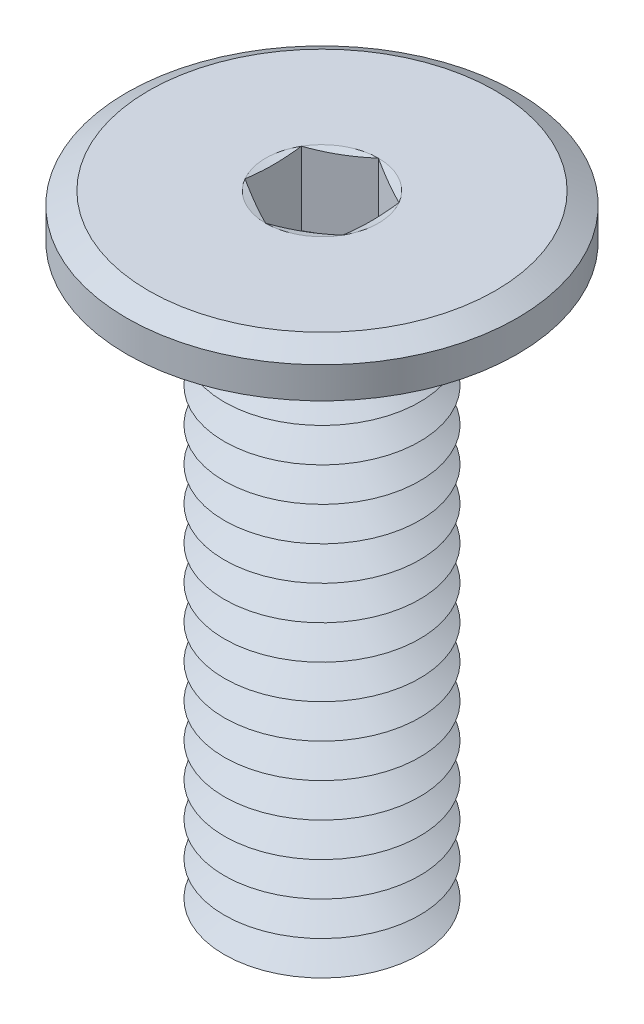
ISO-10303-21;
HEADER;
FILE_DESCRIPTION(('STEP AP214'),'2;1');
FILE_NAME('part.step','',(''),(''),'','','');
FILE_SCHEMA(('AUTOMOTIVE_DESIGN { 1 0 10303 214 1 1 1 1 }'));
ENDSEC;
DATA;
#1=APPLICATION_CONTEXT('core data for automotive mechanical design processes');
#2=APPLICATION_PROTOCOL_DEFINITION('international standard','automotive_design',2000,#1);
#3=PRODUCT_CONTEXT('',#1,'mechanical');
#4=PRODUCT('Part','Part','',(#3));
#5=PRODUCT_RELATED_PRODUCT_CATEGORY('part','',(#4));
#6=PRODUCT_DEFINITION_FORMATION('','',#4);
#7=PRODUCT_DEFINITION_CONTEXT('part definition',#1,'design');
#8=PRODUCT_DEFINITION('design','',#6,#7);
#9=PRODUCT_DEFINITION_SHAPE('','',#8);
#10=(LENGTH_UNIT() NAMED_UNIT(*) SI_UNIT(.MILLI.,.METRE.));
#11=(NAMED_UNIT(*) PLANE_ANGLE_UNIT() SI_UNIT($,.RADIAN.));
#12=(NAMED_UNIT(*) SI_UNIT($,.STERADIAN.) SOLID_ANGLE_UNIT());
#13=UNCERTAINTY_MEASURE_WITH_UNIT(LENGTH_MEASURE(1.E-05),#10,'distance_accuracy_value','');
#14=(GEOMETRIC_REPRESENTATION_CONTEXT(3) GLOBAL_UNCERTAINTY_ASSIGNED_CONTEXT((#13)) GLOBAL_UNIT_ASSIGNED_CONTEXT((#10,
#11,#12)) REPRESENTATION_CONTEXT('',''));
#15=CARTESIAN_POINT('',(0.,0.,0.));
#16=DIRECTION('',(0.,0.,1.));
#17=DIRECTION('',(1.,0.,0.));
#18=AXIS2_PLACEMENT_3D('',#15,#16,#17);
#19=CARTESIAN_POINT('',(0.,-11.85,0.));
#20=DIRECTION('',(0.,-1.,0.));
#21=DIRECTION('',(0.,0.,-1.));
#22=AXIS2_PLACEMENT_3D('',#19,#20,#21);
#23=CONICAL_SURFACE('',#22,2.,1.0471975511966);
#24=CARTESIAN_POINT('',(0.,-11.5,0.));
#25=DIRECTION('',(0.,1.,0.));
#26=DIRECTION('',(0.,0.,1.));
#27=AXIS2_PLACEMENT_3D('',#24,#25,#26);
#28=CIRCLE('',#27,1.39378221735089);
#29=CARTESIAN_POINT('',(0.,-11.5,1.39378221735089));
#30=VERTEX_POINT('',#29);
#31=EDGE_CURVE('E485',#30,#30,#28,.T.);
#32=ORIENTED_EDGE('',*,*,#31,.F.);
#33=EDGE_LOOP('',(#32));
#34=FACE_BOUND('',#33,.T.);
#35=CARTESIAN_POINT('',(0.,-11.85,0.));
#36=DIRECTION('',(0.,1.,0.));
#37=DIRECTION('',(0.,0.,1.));
#38=AXIS2_PLACEMENT_3D('',#35,#36,#37);
#39=CIRCLE('',#38,2.);
#40=CARTESIAN_POINT('',(0.,-11.85,2.));
#41=VERTEX_POINT('',#40);
#42=EDGE_CURVE('E489',#41,#41,#39,.T.);
#43=ORIENTED_EDGE('',*,*,#42,.T.);
#44=EDGE_LOOP('',(#43));
#45=FACE_BOUND('',#44,.T.);
#46=ADVANCED_FACE('F39',(#34,#45),#23,.T.);
#47=CARTESIAN_POINT('',(0.,-11.5,0.));
#48=DIRECTION('',(0.,1.,0.));
#49=DIRECTION('',(0.,0.,1.));
#50=AXIS2_PLACEMENT_3D('',#47,#48,#49);
#51=CONICAL_SURFACE('',#50,1.39378221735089,1.0471975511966);
#52=CARTESIAN_POINT('',(0.,-11.15,0.));
#53=DIRECTION('',(0.,1.,0.));
#54=DIRECTION('',(0.,0.,1.));
#55=AXIS2_PLACEMENT_3D('',#52,#53,#54);
#56=CIRCLE('',#55,2.);
#57=CARTESIAN_POINT('',(0.,-11.15,2.));
#58=VERTEX_POINT('',#57);
#59=EDGE_CURVE('E481',#58,#58,#56,.T.);
#60=ORIENTED_EDGE('',*,*,#59,.F.);
#61=EDGE_LOOP('',(#60));
#62=FACE_BOUND('',#61,.T.);
#63=ORIENTED_EDGE('',*,*,#31,.T.);
#64=EDGE_LOOP('',(#63));
#65=FACE_BOUND('',#64,.T.);
#66=ADVANCED_FACE('F233',(#62,#65),#51,.T.);
#67=CARTESIAN_POINT('',(0.,-12.9,0.));
#68=DIRECTION('',(0.,-1.,0.));
#69=DIRECTION('',(0.,0.,-1.));
#70=AXIS2_PLACEMENT_3D('',#67,#68,#69);
#71=PLANE('',#70);
#72=CARTESIAN_POINT('',(0.,-12.9,0.));
#73=DIRECTION('',(0.,1.,0.));
#74=DIRECTION('',(0.,0.,1.));
#75=AXIS2_PLACEMENT_3D('',#72,#73,#74);
#76=CIRCLE('',#75,1.39378221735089);
#77=CARTESIAN_POINT('',(0.,-12.9,1.39378221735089));
#78=VERTEX_POINT('',#77);
#79=EDGE_CURVE('E300',#78,#78,#76,.T.);
#80=ORIENTED_EDGE('',*,*,#79,.F.);
#81=EDGE_LOOP('',(#80));
#82=FACE_BOUND('',#81,.T.);
#83=ADVANCED_FACE('F239',(#82),#71,.T.);
#84=CARTESIAN_POINT('',(0.,-12.9,0.));
#85=DIRECTION('',(0.,1.,0.));
#86=DIRECTION('',(0.,0.,1.));
#87=AXIS2_PLACEMENT_3D('',#84,#85,#86);
#88=CONICAL_SURFACE('',#87,1.39378221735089,1.0471975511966);
#89=CARTESIAN_POINT('',(0.,-12.55,0.));
#90=DIRECTION('',(0.,1.,0.));
#91=DIRECTION('',(0.,0.,1.));
#92=AXIS2_PLACEMENT_3D('',#89,#90,#91);
#93=CIRCLE('',#92,2.);
#94=CARTESIAN_POINT('',(0.,-12.55,2.));
#95=VERTEX_POINT('',#94);
#96=EDGE_CURVE('E496',#95,#95,#93,.T.);
#97=ORIENTED_EDGE('',*,*,#96,.F.);
#98=EDGE_LOOP('',(#97));
#99=FACE_BOUND('',#98,.T.);
#100=ORIENTED_EDGE('',*,*,#79,.T.);
#101=EDGE_LOOP('',(#100));
#102=FACE_BOUND('',#101,.T.);
#103=ADVANCED_FACE('F254',(#99,#102),#88,.T.);
#104=CARTESIAN_POINT('',(0.,-12.55,0.));
#105=DIRECTION('',(0.,-1.,0.));
#106=DIRECTION('',(0.,0.,-1.));
#107=AXIS2_PLACEMENT_3D('',#104,#105,#106);
#108=CONICAL_SURFACE('',#107,2.,1.0471975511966);
#109=CARTESIAN_POINT('',(0.,-12.2,0.));
#110=DIRECTION('',(0.,1.,0.));
#111=DIRECTION('',(0.,0.,1.));
#112=AXIS2_PLACEMENT_3D('',#109,#110,#111);
#113=CIRCLE('',#112,1.39378221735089);
#114=CARTESIAN_POINT('',(0.,-12.2,1.39378221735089));
#115=VERTEX_POINT('',#114);
#116=EDGE_CURVE('E492',#115,#115,#113,.T.);
#117=ORIENTED_EDGE('',*,*,#116,.F.);
#118=EDGE_LOOP('',(#117));
#119=FACE_BOUND('',#118,.T.);
#120=ORIENTED_EDGE('',*,*,#96,.T.);
#121=EDGE_LOOP('',(#120));
#122=FACE_BOUND('',#121,.T.);
#123=ADVANCED_FACE('F250',(#119,#122),#108,.T.);
#124=CARTESIAN_POINT('',(0.,-12.2,0.));
#125=DIRECTION('',(0.,1.,0.));
#126=DIRECTION('',(0.,0.,1.));
#127=AXIS2_PLACEMENT_3D('',#124,#125,#126);
#128=CONICAL_SURFACE('',#127,1.39378221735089,1.0471975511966);
#129=ORIENTED_EDGE('',*,*,#42,.F.);
#130=EDGE_LOOP('',(#129));
#131=FACE_BOUND('',#130,.T.);
#132=ORIENTED_EDGE('',*,*,#116,.T.);
#133=EDGE_LOOP('',(#132));
#134=FACE_BOUND('',#133,.T.);
#135=ADVANCED_FACE('F246',(#131,#134),#128,.T.);
#136=CARTESIAN_POINT('',(0.,-11.15,0.));
#137=DIRECTION('',(0.,-1.,0.));
#138=DIRECTION('',(0.,0.,-1.));
#139=AXIS2_PLACEMENT_3D('',#136,#137,#138);
#140=CONICAL_SURFACE('',#139,2.,1.0471975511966);
#141=CARTESIAN_POINT('',(0.,-10.8,0.));
#142=DIRECTION('',(0.,1.,0.));
#143=DIRECTION('',(0.,0.,1.));
#144=AXIS2_PLACEMENT_3D('',#141,#142,#143);
#145=CIRCLE('',#144,1.39378221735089);
#146=CARTESIAN_POINT('',(0.,-10.8,1.39378221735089));
#147=VERTEX_POINT('',#146);
#148=EDGE_CURVE('E478',#147,#147,#145,.T.);
#149=ORIENTED_EDGE('',*,*,#148,.F.);
#150=EDGE_LOOP('',(#149));
#151=FACE_BOUND('',#150,.T.);
#152=ORIENTED_EDGE('',*,*,#59,.T.);
#153=EDGE_LOOP('',(#152));
#154=FACE_BOUND('',#153,.T.);
#155=ADVANCED_FACE('F249',(#151,#154),#140,.T.);
#156=CARTESIAN_POINT('',(0.,-10.8,0.));
#157=DIRECTION('',(0.,1.,0.));
#158=DIRECTION('',(0.,0.,1.));
#159=AXIS2_PLACEMENT_3D('',#156,#157,#158);
#160=CONICAL_SURFACE('',#159,1.39378221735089,1.0471975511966);
#161=CARTESIAN_POINT('',(0.,-10.45,0.));
#162=DIRECTION('',(0.,1.,0.));
#163=DIRECTION('',(0.,0.,1.));
#164=AXIS2_PLACEMENT_3D('',#161,#162,#163);
#165=CIRCLE('',#164,2.);
#166=CARTESIAN_POINT('',(0.,-10.45,2.));
#167=VERTEX_POINT('',#166);
#168=EDGE_CURVE('E474',#167,#167,#165,.T.);
#169=ORIENTED_EDGE('',*,*,#168,.F.);
#170=EDGE_LOOP('',(#169));
#171=FACE_BOUND('',#170,.T.);
#172=ORIENTED_EDGE('',*,*,#148,.T.);
#173=EDGE_LOOP('',(#172));
#174=FACE_BOUND('',#173,.T.);
#175=ADVANCED_FACE('F804',(#171,#174),#160,.T.);
#176=CARTESIAN_POINT('',(0.,-10.45,0.));
#177=DIRECTION('',(0.,-1.,0.));
#178=DIRECTION('',(0.,0.,-1.));
#179=AXIS2_PLACEMENT_3D('',#176,#177,#178);
#180=CONICAL_SURFACE('',#179,2.,1.0471975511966);
#181=CARTESIAN_POINT('',(0.,-10.1,0.));
#182=DIRECTION('',(0.,1.,0.));
#183=DIRECTION('',(0.,0.,1.));
#184=AXIS2_PLACEMENT_3D('',#181,#182,#183);
#185=CIRCLE('',#184,1.39378221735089);
#186=CARTESIAN_POINT('',(0.,-10.1,1.39378221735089));
#187=VERTEX_POINT('',#186);
#188=EDGE_CURVE('E470',#187,#187,#185,.T.);
#189=ORIENTED_EDGE('',*,*,#188,.F.);
#190=EDGE_LOOP('',(#189));
#191=FACE_BOUND('',#190,.T.);
#192=ORIENTED_EDGE('',*,*,#168,.T.);
#193=EDGE_LOOP('',(#192));
#194=FACE_BOUND('',#193,.T.);
#195=ADVANCED_FACE('F795',(#191,#194),#180,.T.);
#196=CARTESIAN_POINT('',(0.,-10.1,0.));
#197=DIRECTION('',(0.,1.,0.));
#198=DIRECTION('',(0.,0.,1.));
#199=AXIS2_PLACEMENT_3D('',#196,#197,#198);
#200=CONICAL_SURFACE('',#199,1.39378221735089,1.0471975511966);
#201=CARTESIAN_POINT('',(0.,-9.75,0.));
#202=DIRECTION('',(0.,1.,0.));
#203=DIRECTION('',(0.,0.,1.));
#204=AXIS2_PLACEMENT_3D('',#201,#202,#203);
#205=CIRCLE('',#204,2.);
#206=CARTESIAN_POINT('',(0.,-9.75,2.));
#207=VERTEX_POINT('',#206);
#208=EDGE_CURVE('E466',#207,#207,#205,.T.);
#209=ORIENTED_EDGE('',*,*,#208,.F.);
#210=EDGE_LOOP('',(#209));
#211=FACE_BOUND('',#210,.T.);
#212=ORIENTED_EDGE('',*,*,#188,.T.);
#213=EDGE_LOOP('',(#212));
#214=FACE_BOUND('',#213,.T.);
#215=ADVANCED_FACE('F786',(#211,#214),#200,.T.);
#216=CARTESIAN_POINT('',(0.,-9.75,0.));
#217=DIRECTION('',(0.,-1.,0.));
#218=DIRECTION('',(0.,0.,-1.));
#219=AXIS2_PLACEMENT_3D('',#216,#217,#218);
#220=CONICAL_SURFACE('',#219,2.,1.0471975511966);
#221=CARTESIAN_POINT('',(0.,-9.4,0.));
#222=DIRECTION('',(0.,1.,0.));
#223=DIRECTION('',(0.,0.,1.));
#224=AXIS2_PLACEMENT_3D('',#221,#222,#223);
#225=CIRCLE('',#224,1.39378221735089);
#226=CARTESIAN_POINT('',(0.,-9.4,1.39378221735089));
#227=VERTEX_POINT('',#226);
#228=EDGE_CURVE('E462',#227,#227,#225,.T.);
#229=ORIENTED_EDGE('',*,*,#228,.F.);
#230=EDGE_LOOP('',(#229));
#231=FACE_BOUND('',#230,.T.);
#232=ORIENTED_EDGE('',*,*,#208,.T.);
#233=EDGE_LOOP('',(#232));
#234=FACE_BOUND('',#233,.T.);
#235=ADVANCED_FACE('F777',(#231,#234),#220,.T.);
#236=CARTESIAN_POINT('',(0.,-9.4,0.));
#237=DIRECTION('',(0.,1.,0.));
#238=DIRECTION('',(0.,0.,1.));
#239=AXIS2_PLACEMENT_3D('',#236,#237,#238);
#240=CONICAL_SURFACE('',#239,1.39378221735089,1.0471975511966);
#241=CARTESIAN_POINT('',(0.,-9.05,0.));
#242=DIRECTION('',(0.,1.,0.));
#243=DIRECTION('',(0.,0.,1.));
#244=AXIS2_PLACEMENT_3D('',#241,#242,#243);
#245=CIRCLE('',#244,2.);
#246=CARTESIAN_POINT('',(0.,-9.05,2.));
#247=VERTEX_POINT('',#246);
#248=EDGE_CURVE('E458',#247,#247,#245,.T.);
#249=ORIENTED_EDGE('',*,*,#248,.F.);
#250=EDGE_LOOP('',(#249));
#251=FACE_BOUND('',#250,.T.);
#252=ORIENTED_EDGE('',*,*,#228,.T.);
#253=EDGE_LOOP('',(#252));
#254=FACE_BOUND('',#253,.T.);
#255=ADVANCED_FACE('F768',(#251,#254),#240,.T.);
#256=CARTESIAN_POINT('',(0.,-9.05,0.));
#257=DIRECTION('',(0.,-1.,0.));
#258=DIRECTION('',(0.,0.,-1.));
#259=AXIS2_PLACEMENT_3D('',#256,#257,#258);
#260=CONICAL_SURFACE('',#259,2.,1.0471975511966);
#261=CARTESIAN_POINT('',(0.,-8.7,0.));
#262=DIRECTION('',(0.,1.,0.));
#263=DIRECTION('',(0.,0.,1.));
#264=AXIS2_PLACEMENT_3D('',#261,#262,#263);
#265=CIRCLE('',#264,1.39378221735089);
#266=CARTESIAN_POINT('',(0.,-8.7,1.39378221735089));
#267=VERTEX_POINT('',#266);
#268=EDGE_CURVE('E454',#267,#267,#265,.T.);
#269=ORIENTED_EDGE('',*,*,#268,.F.);
#270=EDGE_LOOP('',(#269));
#271=FACE_BOUND('',#270,.T.);
#272=ORIENTED_EDGE('',*,*,#248,.T.);
#273=EDGE_LOOP('',(#272));
#274=FACE_BOUND('',#273,.T.);
#275=ADVANCED_FACE('F759',(#271,#274),#260,.T.);
#276=CARTESIAN_POINT('',(0.,-8.7,0.));
#277=DIRECTION('',(0.,1.,0.));
#278=DIRECTION('',(0.,0.,1.));
#279=AXIS2_PLACEMENT_3D('',#276,#277,#278);
#280=CONICAL_SURFACE('',#279,1.39378221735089,1.0471975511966);
#281=CARTESIAN_POINT('',(0.,-8.35,0.));
#282=DIRECTION('',(0.,1.,0.));
#283=DIRECTION('',(0.,0.,1.));
#284=AXIS2_PLACEMENT_3D('',#281,#282,#283);
#285=CIRCLE('',#284,2.);
#286=CARTESIAN_POINT('',(0.,-8.35,2.));
#287=VERTEX_POINT('',#286);
#288=EDGE_CURVE('E450',#287,#287,#285,.T.);
#289=ORIENTED_EDGE('',*,*,#288,.F.);
#290=EDGE_LOOP('',(#289));
#291=FACE_BOUND('',#290,.T.);
#292=ORIENTED_EDGE('',*,*,#268,.T.);
#293=EDGE_LOOP('',(#292));
#294=FACE_BOUND('',#293,.T.);
#295=ADVANCED_FACE('F750',(#291,#294),#280,.T.);
#296=CARTESIAN_POINT('',(0.,-8.35,0.));
#297=DIRECTION('',(0.,-1.,0.));
#298=DIRECTION('',(0.,0.,-1.));
#299=AXIS2_PLACEMENT_3D('',#296,#297,#298);
#300=CONICAL_SURFACE('',#299,2.,1.0471975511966);
#301=CARTESIAN_POINT('',(0.,-8.,0.));
#302=DIRECTION('',(0.,1.,0.));
#303=DIRECTION('',(0.,0.,1.));
#304=AXIS2_PLACEMENT_3D('',#301,#302,#303);
#305=CIRCLE('',#304,1.39378221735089);
#306=CARTESIAN_POINT('',(0.,-8.,1.39378221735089));
#307=VERTEX_POINT('',#306);
#308=EDGE_CURVE('E446',#307,#307,#305,.T.);
#309=ORIENTED_EDGE('',*,*,#308,.F.);
#310=EDGE_LOOP('',(#309));
#311=FACE_BOUND('',#310,.T.);
#312=ORIENTED_EDGE('',*,*,#288,.T.);
#313=EDGE_LOOP('',(#312));
#314=FACE_BOUND('',#313,.T.);
#315=ADVANCED_FACE('F741',(#311,#314),#300,.T.);
#316=CARTESIAN_POINT('',(0.,-8.,0.));
#317=DIRECTION('',(0.,1.,0.));
#318=DIRECTION('',(0.,0.,1.));
#319=AXIS2_PLACEMENT_3D('',#316,#317,#318);
#320=CONICAL_SURFACE('',#319,1.39378221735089,1.0471975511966);
#321=CARTESIAN_POINT('',(0.,-7.65,0.));
#322=DIRECTION('',(0.,1.,0.));
#323=DIRECTION('',(0.,0.,1.));
#324=AXIS2_PLACEMENT_3D('',#321,#322,#323);
#325=CIRCLE('',#324,2.);
#326=CARTESIAN_POINT('',(0.,-7.65,2.));
#327=VERTEX_POINT('',#326);
#328=EDGE_CURVE('E442',#327,#327,#325,.T.);
#329=ORIENTED_EDGE('',*,*,#328,.F.);
#330=EDGE_LOOP('',(#329));
#331=FACE_BOUND('',#330,.T.);
#332=ORIENTED_EDGE('',*,*,#308,.T.);
#333=EDGE_LOOP('',(#332));
#334=FACE_BOUND('',#333,.T.);
#335=ADVANCED_FACE('F732',(#331,#334),#320,.T.);
#336=CARTESIAN_POINT('',(0.,-7.65,0.));
#337=DIRECTION('',(0.,-1.,0.));
#338=DIRECTION('',(0.,0.,-1.));
#339=AXIS2_PLACEMENT_3D('',#336,#337,#338);
#340=CONICAL_SURFACE('',#339,2.,1.0471975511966);
#341=CARTESIAN_POINT('',(0.,-7.3,0.));
#342=DIRECTION('',(0.,1.,0.));
#343=DIRECTION('',(0.,0.,1.));
#344=AXIS2_PLACEMENT_3D('',#341,#342,#343);
#345=CIRCLE('',#344,1.39378221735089);
#346=CARTESIAN_POINT('',(0.,-7.3,1.39378221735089));
#347=VERTEX_POINT('',#346);
#348=EDGE_CURVE('E438',#347,#347,#345,.T.);
#349=ORIENTED_EDGE('',*,*,#348,.F.);
#350=EDGE_LOOP('',(#349));
#351=FACE_BOUND('',#350,.T.);
#352=ORIENTED_EDGE('',*,*,#328,.T.);
#353=EDGE_LOOP('',(#352));
#354=FACE_BOUND('',#353,.T.);
#355=ADVANCED_FACE('F723',(#351,#354),#340,.T.);
#356=CARTESIAN_POINT('',(0.,-7.3,0.));
#357=DIRECTION('',(0.,1.,0.));
#358=DIRECTION('',(0.,0.,1.));
#359=AXIS2_PLACEMENT_3D('',#356,#357,#358);
#360=CONICAL_SURFACE('',#359,1.39378221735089,1.0471975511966);
#361=CARTESIAN_POINT('',(0.,-6.95,0.));
#362=DIRECTION('',(0.,1.,0.));
#363=DIRECTION('',(0.,0.,1.));
#364=AXIS2_PLACEMENT_3D('',#361,#362,#363);
#365=CIRCLE('',#364,2.);
#366=CARTESIAN_POINT('',(0.,-6.95,2.));
#367=VERTEX_POINT('',#366);
#368=EDGE_CURVE('E434',#367,#367,#365,.T.);
#369=ORIENTED_EDGE('',*,*,#368,.F.);
#370=EDGE_LOOP('',(#369));
#371=FACE_BOUND('',#370,.T.);
#372=ORIENTED_EDGE('',*,*,#348,.T.);
#373=EDGE_LOOP('',(#372));
#374=FACE_BOUND('',#373,.T.);
#375=ADVANCED_FACE('F714',(#371,#374),#360,.T.);
#376=CARTESIAN_POINT('',(0.,-6.95,0.));
#377=DIRECTION('',(0.,-1.,0.));
#378=DIRECTION('',(0.,0.,-1.));
#379=AXIS2_PLACEMENT_3D('',#376,#377,#378);
#380=CONICAL_SURFACE('',#379,2.,1.0471975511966);
#381=CARTESIAN_POINT('',(0.,-6.6,0.));
#382=DIRECTION('',(0.,1.,0.));
#383=DIRECTION('',(0.,0.,1.));
#384=AXIS2_PLACEMENT_3D('',#381,#382,#383);
#385=CIRCLE('',#384,1.39378221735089);
#386=CARTESIAN_POINT('',(0.,-6.6,1.39378221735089));
#387=VERTEX_POINT('',#386);
#388=EDGE_CURVE('E430',#387,#387,#385,.T.);
#389=ORIENTED_EDGE('',*,*,#388,.F.);
#390=EDGE_LOOP('',(#389));
#391=FACE_BOUND('',#390,.T.);
#392=ORIENTED_EDGE('',*,*,#368,.T.);
#393=EDGE_LOOP('',(#392));
#394=FACE_BOUND('',#393,.T.);
#395=ADVANCED_FACE('F705',(#391,#394),#380,.T.);
#396=CARTESIAN_POINT('',(0.,-6.6,0.));
#397=DIRECTION('',(0.,1.,0.));
#398=DIRECTION('',(0.,0.,1.));
#399=AXIS2_PLACEMENT_3D('',#396,#397,#398);
#400=CONICAL_SURFACE('',#399,1.39378221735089,1.0471975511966);
#401=CARTESIAN_POINT('',(0.,-6.25,0.));
#402=DIRECTION('',(0.,1.,0.));
#403=DIRECTION('',(0.,0.,1.));
#404=AXIS2_PLACEMENT_3D('',#401,#402,#403);
#405=CIRCLE('',#404,2.);
#406=CARTESIAN_POINT('',(0.,-6.25,2.));
#407=VERTEX_POINT('',#406);
#408=EDGE_CURVE('E426',#407,#407,#405,.T.);
#409=ORIENTED_EDGE('',*,*,#408,.F.);
#410=EDGE_LOOP('',(#409));
#411=FACE_BOUND('',#410,.T.);
#412=ORIENTED_EDGE('',*,*,#388,.T.);
#413=EDGE_LOOP('',(#412));
#414=FACE_BOUND('',#413,.T.);
#415=ADVANCED_FACE('F696',(#411,#414),#400,.T.);
#416=CARTESIAN_POINT('',(0.,-6.25,0.));
#417=DIRECTION('',(0.,-1.,0.));
#418=DIRECTION('',(0.,0.,-1.));
#419=AXIS2_PLACEMENT_3D('',#416,#417,#418);
#420=CONICAL_SURFACE('',#419,2.,1.0471975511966);
#421=CARTESIAN_POINT('',(0.,-5.9,0.));
#422=DIRECTION('',(0.,1.,0.));
#423=DIRECTION('',(0.,0.,1.));
#424=AXIS2_PLACEMENT_3D('',#421,#422,#423);
#425=CIRCLE('',#424,1.39378221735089);
#426=CARTESIAN_POINT('',(0.,-5.9,1.39378221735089));
#427=VERTEX_POINT('',#426);
#428=EDGE_CURVE('E422',#427,#427,#425,.T.);
#429=ORIENTED_EDGE('',*,*,#428,.F.);
#430=EDGE_LOOP('',(#429));
#431=FACE_BOUND('',#430,.T.);
#432=ORIENTED_EDGE('',*,*,#408,.T.);
#433=EDGE_LOOP('',(#432));
#434=FACE_BOUND('',#433,.T.);
#435=ADVANCED_FACE('F687',(#431,#434),#420,.T.);
#436=CARTESIAN_POINT('',(0.,-5.9,0.));
#437=DIRECTION('',(0.,1.,0.));
#438=DIRECTION('',(0.,0.,1.));
#439=AXIS2_PLACEMENT_3D('',#436,#437,#438);
#440=CONICAL_SURFACE('',#439,1.39378221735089,1.0471975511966);
#441=CARTESIAN_POINT('',(0.,-5.55,0.));
#442=DIRECTION('',(0.,1.,0.));
#443=DIRECTION('',(0.,0.,1.));
#444=AXIS2_PLACEMENT_3D('',#441,#442,#443);
#445=CIRCLE('',#444,2.);
#446=CARTESIAN_POINT('',(0.,-5.55,2.));
#447=VERTEX_POINT('',#446);
#448=EDGE_CURVE('E418',#447,#447,#445,.T.);
#449=ORIENTED_EDGE('',*,*,#448,.F.);
#450=EDGE_LOOP('',(#449));
#451=FACE_BOUND('',#450,.T.);
#452=ORIENTED_EDGE('',*,*,#428,.T.);
#453=EDGE_LOOP('',(#452));
#454=FACE_BOUND('',#453,.T.);
#455=ADVANCED_FACE('F678',(#451,#454),#440,.T.);
#456=CARTESIAN_POINT('',(0.,-5.55,0.));
#457=DIRECTION('',(0.,-1.,0.));
#458=DIRECTION('',(0.,0.,-1.));
#459=AXIS2_PLACEMENT_3D('',#456,#457,#458);
#460=CONICAL_SURFACE('',#459,2.,1.0471975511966);
#461=CARTESIAN_POINT('',(0.,-5.2,0.));
#462=DIRECTION('',(0.,1.,0.));
#463=DIRECTION('',(0.,0.,1.));
#464=AXIS2_PLACEMENT_3D('',#461,#462,#463);
#465=CIRCLE('',#464,1.39378221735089);
#466=CARTESIAN_POINT('',(0.,-5.2,1.39378221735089));
#467=VERTEX_POINT('',#466);
#468=EDGE_CURVE('E414',#467,#467,#465,.T.);
#469=ORIENTED_EDGE('',*,*,#468,.F.);
#470=EDGE_LOOP('',(#469));
#471=FACE_BOUND('',#470,.T.);
#472=ORIENTED_EDGE('',*,*,#448,.T.);
#473=EDGE_LOOP('',(#472));
#474=FACE_BOUND('',#473,.T.);
#475=ADVANCED_FACE('F669',(#471,#474),#460,.T.);
#476=CARTESIAN_POINT('',(0.,-5.2,0.));
#477=DIRECTION('',(0.,1.,0.));
#478=DIRECTION('',(0.,0.,1.));
#479=AXIS2_PLACEMENT_3D('',#476,#477,#478);
#480=CONICAL_SURFACE('',#479,1.39378221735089,1.0471975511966);
#481=CARTESIAN_POINT('',(0.,-4.85,0.));
#482=DIRECTION('',(0.,1.,0.));
#483=DIRECTION('',(0.,0.,1.));
#484=AXIS2_PLACEMENT_3D('',#481,#482,#483);
#485=CIRCLE('',#484,2.);
#486=CARTESIAN_POINT('',(0.,-4.85,2.));
#487=VERTEX_POINT('',#486);
#488=EDGE_CURVE('E410',#487,#487,#485,.T.);
#489=ORIENTED_EDGE('',*,*,#488,.F.);
#490=EDGE_LOOP('',(#489));
#491=FACE_BOUND('',#490,.T.);
#492=ORIENTED_EDGE('',*,*,#468,.T.);
#493=EDGE_LOOP('',(#492));
#494=FACE_BOUND('',#493,.T.);
#495=ADVANCED_FACE('F660',(#491,#494),#480,.T.);
#496=CARTESIAN_POINT('',(0.,-4.85,0.));
#497=DIRECTION('',(0.,-1.,0.));
#498=DIRECTION('',(0.,0.,-1.));
#499=AXIS2_PLACEMENT_3D('',#496,#497,#498);
#500=CONICAL_SURFACE('',#499,2.,1.0471975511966);
#501=CARTESIAN_POINT('',(0.,-4.5,0.));
#502=DIRECTION('',(0.,1.,0.));
#503=DIRECTION('',(0.,0.,1.));
#504=AXIS2_PLACEMENT_3D('',#501,#502,#503);
#505=CIRCLE('',#504,1.39378221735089);
#506=CARTESIAN_POINT('',(0.,-4.5,1.39378221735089));
#507=VERTEX_POINT('',#506);
#508=EDGE_CURVE('E407',#507,#507,#505,.T.);
#509=ORIENTED_EDGE('',*,*,#508,.F.);
#510=EDGE_LOOP('',(#509));
#511=FACE_BOUND('',#510,.T.);
#512=ORIENTED_EDGE('',*,*,#488,.T.);
#513=EDGE_LOOP('',(#512));
#514=FACE_BOUND('',#513,.T.);
#515=ADVANCED_FACE('F651',(#511,#514),#500,.T.);
#516=CARTESIAN_POINT('',(0.,-4.5,0.));
#517=DIRECTION('',(0.,1.,0.));
#518=DIRECTION('',(0.,0.,1.));
#519=AXIS2_PLACEMENT_3D('',#516,#517,#518);
#520=CONICAL_SURFACE('',#519,1.39378221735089,1.0471975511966);
#521=CARTESIAN_POINT('',(0.,-4.15,0.));
#522=DIRECTION('',(0.,1.,0.));
#523=DIRECTION('',(0.,0.,1.));
#524=AXIS2_PLACEMENT_3D('',#521,#522,#523);
#525=CIRCLE('',#524,2.);
#526=CARTESIAN_POINT('',(0.,-4.15,2.));
#527=VERTEX_POINT('',#526);
#528=EDGE_CURVE('E403',#527,#527,#525,.T.);
#529=ORIENTED_EDGE('',*,*,#528,.F.);
#530=EDGE_LOOP('',(#529));
#531=FACE_BOUND('',#530,.T.);
#532=ORIENTED_EDGE('',*,*,#508,.T.);
#533=EDGE_LOOP('',(#532));
#534=FACE_BOUND('',#533,.T.);
#535=ADVANCED_FACE('F642',(#531,#534),#520,.T.);
#536=CARTESIAN_POINT('',(0.,-4.15,0.));
#537=DIRECTION('',(0.,-1.,0.));
#538=DIRECTION('',(0.,0.,-1.));
#539=AXIS2_PLACEMENT_3D('',#536,#537,#538);
#540=CONICAL_SURFACE('',#539,2.,1.0471975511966);
#541=CARTESIAN_POINT('',(0.,-3.8,0.));
#542=DIRECTION('',(0.,1.,0.));
#543=DIRECTION('',(0.,0.,1.));
#544=AXIS2_PLACEMENT_3D('',#541,#542,#543);
#545=CIRCLE('',#544,1.39378221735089);
#546=CARTESIAN_POINT('',(0.,-3.8,1.39378221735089));
#547=VERTEX_POINT('',#546);
#548=EDGE_CURVE('E399',#547,#547,#545,.T.);
#549=ORIENTED_EDGE('',*,*,#548,.F.);
#550=EDGE_LOOP('',(#549));
#551=FACE_BOUND('',#550,.T.);
#552=ORIENTED_EDGE('',*,*,#528,.T.);
#553=EDGE_LOOP('',(#552));
#554=FACE_BOUND('',#553,.T.);
#555=ADVANCED_FACE('F633',(#551,#554),#540,.T.);
#556=CARTESIAN_POINT('',(0.,-3.8,0.));
#557=DIRECTION('',(0.,1.,0.));
#558=DIRECTION('',(0.,0.,1.));
#559=AXIS2_PLACEMENT_3D('',#556,#557,#558);
#560=CONICAL_SURFACE('',#559,1.39378221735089,1.0471975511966);
#561=CARTESIAN_POINT('',(0.,-3.45,0.));
#562=DIRECTION('',(0.,1.,0.));
#563=DIRECTION('',(0.,0.,1.));
#564=AXIS2_PLACEMENT_3D('',#561,#562,#563);
#565=CIRCLE('',#564,2.);
#566=CARTESIAN_POINT('',(0.,-3.45,2.));
#567=VERTEX_POINT('',#566);
#568=EDGE_CURVE('E395',#567,#567,#565,.T.);
#569=ORIENTED_EDGE('',*,*,#568,.F.);
#570=EDGE_LOOP('',(#569));
#571=FACE_BOUND('',#570,.T.);
#572=ORIENTED_EDGE('',*,*,#548,.T.);
#573=EDGE_LOOP('',(#572));
#574=FACE_BOUND('',#573,.T.);
#575=ADVANCED_FACE('F624',(#571,#574),#560,.T.);
#576=CARTESIAN_POINT('',(0.,-3.45,0.));
#577=DIRECTION('',(0.,-1.,0.));
#578=DIRECTION('',(0.,0.,-1.));
#579=AXIS2_PLACEMENT_3D('',#576,#577,#578);
#580=CONICAL_SURFACE('',#579,2.,1.0471975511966);
#581=CARTESIAN_POINT('',(0.,-3.1,0.));
#582=DIRECTION('',(0.,1.,0.));
#583=DIRECTION('',(0.,0.,1.));
#584=AXIS2_PLACEMENT_3D('',#581,#582,#583);
#585=CIRCLE('',#584,1.39378221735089);
#586=CARTESIAN_POINT('',(0.,-3.1,1.39378221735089));
#587=VERTEX_POINT('',#586);
#588=EDGE_CURVE('E391',#587,#587,#585,.T.);
#589=ORIENTED_EDGE('',*,*,#588,.F.);
#590=EDGE_LOOP('',(#589));
#591=FACE_BOUND('',#590,.T.);
#592=ORIENTED_EDGE('',*,*,#568,.T.);
#593=EDGE_LOOP('',(#592));
#594=FACE_BOUND('',#593,.T.);
#595=ADVANCED_FACE('F615',(#591,#594),#580,.T.);
#596=CARTESIAN_POINT('',(0.,-3.1,0.));
#597=DIRECTION('',(0.,1.,0.));
#598=DIRECTION('',(0.,0.,1.));
#599=AXIS2_PLACEMENT_3D('',#596,#597,#598);
#600=CONICAL_SURFACE('',#599,1.39378221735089,1.0471975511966);
#601=CARTESIAN_POINT('',(0.,-2.75,0.));
#602=DIRECTION('',(0.,1.,0.));
#603=DIRECTION('',(0.,0.,1.));
#604=AXIS2_PLACEMENT_3D('',#601,#602,#603);
#605=CIRCLE('',#604,2.);
#606=CARTESIAN_POINT('',(0.,-2.75,2.));
#607=VERTEX_POINT('',#606);
#608=EDGE_CURVE('E387',#607,#607,#605,.T.);
#609=ORIENTED_EDGE('',*,*,#608,.F.);
#610=EDGE_LOOP('',(#609));
#611=FACE_BOUND('',#610,.T.);
#612=ORIENTED_EDGE('',*,*,#588,.T.);
#613=EDGE_LOOP('',(#612));
#614=FACE_BOUND('',#613,.T.);
#615=ADVANCED_FACE('F606',(#611,#614),#600,.T.);
#616=CARTESIAN_POINT('',(0.,-2.75,0.));
#617=DIRECTION('',(0.,-1.,0.));
#618=DIRECTION('',(0.,0.,-1.));
#619=AXIS2_PLACEMENT_3D('',#616,#617,#618);
#620=CONICAL_SURFACE('',#619,2.,1.0471975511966);
#621=CARTESIAN_POINT('',(0.,-2.4,0.));
#622=DIRECTION('',(0.,1.,0.));
#623=DIRECTION('',(0.,0.,1.));
#624=AXIS2_PLACEMENT_3D('',#621,#622,#623);
#625=CIRCLE('',#624,1.39378221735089);
#626=CARTESIAN_POINT('',(0.,-2.4,1.39378221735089));
#627=VERTEX_POINT('',#626);
#628=EDGE_CURVE('E384',#627,#627,#625,.T.);
#629=ORIENTED_EDGE('',*,*,#628,.F.);
#630=EDGE_LOOP('',(#629));
#631=FACE_BOUND('',#630,.T.);
#632=ORIENTED_EDGE('',*,*,#608,.T.);
#633=EDGE_LOOP('',(#632));
#634=FACE_BOUND('',#633,.T.);
#635=ADVANCED_FACE('F597',(#631,#634),#620,.T.);
#636=CARTESIAN_POINT('',(0.,-2.4,0.));
#637=DIRECTION('',(0.,1.,0.));
#638=DIRECTION('',(0.,0.,1.));
#639=AXIS2_PLACEMENT_3D('',#636,#637,#638);
#640=CONICAL_SURFACE('',#639,1.39378221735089,1.0471975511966);
#641=CARTESIAN_POINT('',(0.,-2.05,0.));
#642=DIRECTION('',(0.,1.,0.));
#643=DIRECTION('',(0.,0.,1.));
#644=AXIS2_PLACEMENT_3D('',#641,#642,#643);
#645=CIRCLE('',#644,2.);
#646=CARTESIAN_POINT('',(0.,-2.05,2.));
#647=VERTEX_POINT('',#646);
#648=EDGE_CURVE('E369',#647,#647,#645,.T.);
#649=ORIENTED_EDGE('',*,*,#648,.F.);
#650=EDGE_LOOP('',(#649));
#651=FACE_BOUND('',#650,.T.);
#652=ORIENTED_EDGE('',*,*,#628,.T.);
#653=EDGE_LOOP('',(#652));
#654=FACE_BOUND('',#653,.T.);
#655=ADVANCED_FACE('F274',(#651,#654),#640,.T.);
#656=CARTESIAN_POINT('',(0.,0.,0.));
#657=DIRECTION('',(0.,1.,0.));
#658=DIRECTION('',(0.,0.,1.));
#659=AXIS2_PLACEMENT_3D('',#656,#657,#658);
#660=PLANE('',#659);
#661=CARTESIAN_POINT('',(0.,0.,0.));
#662=DIRECTION('',(0.,1.,0.));
#663=DIRECTION('',(0.,0.,1.));
#664=AXIS2_PLACEMENT_3D('',#661,#662,#663);
#665=CIRCLE('',#664,1.15470053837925);
#666=CARTESIAN_POINT('',(0.,0.,1.15470053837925));
#667=VERTEX_POINT('',#666);
#668=CARTESIAN_POINT('',(1.,0.,0.577350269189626));
#669=VERTEX_POINT('',#668);
#670=EDGE_CURVE('E66',#667,#669,#665,.T.);
#671=ORIENTED_EDGE('',*,*,#670,.F.);
#672=CARTESIAN_POINT('',(-1.,0.,0.577350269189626));
#673=VERTEX_POINT('',#672);
#674=EDGE_CURVE('E169',#673,#667,#665,.T.);
#675=ORIENTED_EDGE('',*,*,#674,.F.);
#676=CARTESIAN_POINT('',(-1.,0.,-0.577350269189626));
#677=VERTEX_POINT('',#676);
#678=EDGE_CURVE('E164',#677,#673,#665,.T.);
#679=ORIENTED_EDGE('',*,*,#678,.F.);
#680=CARTESIAN_POINT('',(0.,0.,-1.15470053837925));
#681=VERTEX_POINT('',#680);
#682=EDGE_CURVE('E128',#681,#677,#665,.T.);
#683=ORIENTED_EDGE('',*,*,#682,.F.);
#684=CARTESIAN_POINT('',(1.,0.,-0.577350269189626));
#685=VERTEX_POINT('',#684);
#686=EDGE_CURVE('E119',#685,#681,#665,.T.);
#687=ORIENTED_EDGE('',*,*,#686,.F.);
#688=EDGE_CURVE('E59',#669,#685,#665,.T.);
#689=ORIENTED_EDGE('',*,*,#688,.F.);
#690=EDGE_LOOP('',(#671,#675,#679,#683,#687,#689));
#691=FACE_BOUND('',#690,.T.);
#692=CARTESIAN_POINT('',(0.,0.,0.));
#693=DIRECTION('',(0.,1.,0.));
#694=DIRECTION('',(0.,0.,1.));
#695=AXIS2_PLACEMENT_3D('',#692,#693,#694);
#696=CIRCLE('',#695,3.55);
#697=CARTESIAN_POINT('',(0.,0.,3.55));
#698=VERTEX_POINT('',#697);
#699=EDGE_CURVE('E296',#698,#698,#696,.T.);
#700=ORIENTED_EDGE('',*,*,#699,.T.);
#701=EDGE_LOOP('',(#700));
#702=FACE_BOUND('',#701,.T.);
#703=ADVANCED_FACE('F160',(#691,#702),#660,.T.);
#704=CARTESIAN_POINT('',(0.,-0.9,0.));
#705=DIRECTION('',(0.,1.,0.));
#706=DIRECTION('',(0.,0.,1.));
#707=AXIS2_PLACEMENT_3D('',#704,#705,#706);
#708=CYLINDRICAL_SURFACE('',#707,4.);
#709=CARTESIAN_POINT('',(0.,-0.259807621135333,0.));
#710=DIRECTION('',(0.,1.,0.));
#711=DIRECTION('',(0.,0.,1.));
#712=AXIS2_PLACEMENT_3D('',#709,#710,#711);
#713=CIRCLE('',#712,4.);
#714=CARTESIAN_POINT('',(0.,-0.259807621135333,4.));
#715=VERTEX_POINT('',#714);
#716=EDGE_CURVE('E307',#715,#715,#713,.F.);
#717=ORIENTED_EDGE('',*,*,#716,.T.);
#718=EDGE_LOOP('',(#717));
#719=FACE_BOUND('',#718,.T.);
#720=CARTESIAN_POINT('',(0.,-0.9,0.));
#721=DIRECTION('',(0.,1.,0.));
#722=DIRECTION('',(0.,0.,1.));
#723=AXIS2_PLACEMENT_3D('',#720,#721,#722);
#724=CIRCLE('',#723,4.);
#725=CARTESIAN_POINT('',(0.,-0.9,4.));
#726=VERTEX_POINT('',#725);
#727=EDGE_CURVE('E291',#726,#726,#724,.T.);
#728=ORIENTED_EDGE('',*,*,#727,.T.);
#729=EDGE_LOOP('',(#728));
#730=FACE_BOUND('',#729,.T.);
#731=ADVANCED_FACE('F270',(#719,#730),#708,.T.);
#732=CARTESIAN_POINT('',(0.,-0.9,0.));
#733=DIRECTION('',(0.,1.,0.));
#734=DIRECTION('',(0.,0.,1.));
#735=AXIS2_PLACEMENT_3D('',#732,#733,#734);
#736=PLANE('',#735);
#737=CARTESIAN_POINT('',(0.,-0.9,0.));
#738=DIRECTION('',(0.,1.,0.));
#739=DIRECTION('',(0.,0.,1.));
#740=AXIS2_PLACEMENT_3D('',#737,#738,#739);
#741=CIRCLE('',#740,2.2);
#742=CARTESIAN_POINT('',(0.,-0.9,2.2));
#743=VERTEX_POINT('',#742);
#744=EDGE_CURVE('E286',#743,#743,#741,.T.);
#745=ORIENTED_EDGE('',*,*,#744,.T.);
#746=EDGE_LOOP('',(#745));
#747=FACE_BOUND('',#746,.T.);
#748=ORIENTED_EDGE('',*,*,#727,.F.);
#749=EDGE_LOOP('',(#748));
#750=FACE_BOUND('',#749,.T.);
#751=ADVANCED_FACE('F266',(#747,#750),#736,.F.);
#752=CARTESIAN_POINT('',(0.,-12.9,0.));
#753=DIRECTION('',(0.,1.,0.));
#754=DIRECTION('',(0.,0.,1.));
#755=AXIS2_PLACEMENT_3D('',#752,#753,#754);
#756=CYLINDRICAL_SURFACE('',#755,2.);
#757=CARTESIAN_POINT('',(0.,-1.1,0.));
#758=DIRECTION('',(0.,1.,0.));
#759=DIRECTION('',(0.,0.,1.));
#760=AXIS2_PLACEMENT_3D('',#757,#758,#759);
#761=CIRCLE('',#760,2.);
#762=CARTESIAN_POINT('',(0.,-1.1,2.));
#763=VERTEX_POINT('',#762);
#764=EDGE_CURVE('E289',#763,#763,#761,.F.);
#765=ORIENTED_EDGE('',*,*,#764,.T.);
#766=EDGE_LOOP('',(#765));
#767=FACE_BOUND('',#766,.T.);
#768=ORIENTED_EDGE('',*,*,#648,.T.);
#769=EDGE_LOOP('',(#768));
#770=FACE_BOUND('',#769,.T.);
#771=ADVANCED_FACE('F262',(#767,#770),#756,.T.);
#772=CARTESIAN_POINT('',(0.,-1.1,0.));
#773=DIRECTION('',(0.,1.,0.));
#774=DIRECTION('',(0.,0.,1.));
#775=AXIS2_PLACEMENT_3D('',#772,#773,#774);
#776=TOROIDAL_SURFACE('',#775,2.2,0.2);
#777=ORIENTED_EDGE('',*,*,#744,.F.);
#778=EDGE_LOOP('',(#777));
#779=FACE_BOUND('',#778,.T.);
#780=ORIENTED_EDGE('',*,*,#764,.F.);
#781=EDGE_LOOP('',(#780));
#782=FACE_BOUND('',#781,.T.);
#783=ADVANCED_FACE('F265',(#779,#782),#776,.F.);
#784=CARTESIAN_POINT('',(0.,0.,0.));
#785=DIRECTION('',(0.,-1.,0.));
#786=DIRECTION('',(0.,0.,-1.));
#787=AXIS2_PLACEMENT_3D('',#784,#785,#786);
#788=CONICAL_SURFACE('',#787,3.55,1.0471975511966);
#789=ORIENTED_EDGE('',*,*,#716,.F.);
#790=EDGE_LOOP('',(#789));
#791=FACE_BOUND('',#790,.T.);
#792=ORIENTED_EDGE('',*,*,#699,.F.);
#793=EDGE_LOOP('',(#792));
#794=FACE_BOUND('',#793,.T.);
#795=ADVANCED_FACE('F41',(#791,#794),#788,.T.);
#796=CARTESIAN_POINT('',(0.,0.,0.));
#797=DIRECTION('',(0.,1.,0.));
#798=DIRECTION('',(0.,0.,1.));
#799=AXIS2_PLACEMENT_3D('',#796,#797,#798);
#800=CONICAL_SURFACE('',#799,1.15470053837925,1.30899693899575);
#801=ORIENTED_EDGE('',*,*,#682,.T.);
#802=CARTESIAN_POINT('',(0.000200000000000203,3.09447482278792E-05,-1.15481600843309));
#803=CARTESIAN_POINT('',(-0.0413440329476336,-0.00640029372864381,-1.13083054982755));
#804=CARTESIAN_POINT('',(-0.0829634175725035,-0.012238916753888,-1.10680158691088));
#805=CARTESIAN_POINT('',(-0.166349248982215,-0.0224969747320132,-1.05865875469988));
#806=CARTESIAN_POINT('',(-0.208115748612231,-0.0269158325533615,-1.03454485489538));
#807=CARTESIAN_POINT('',(-0.291542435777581,-0.0340762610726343,-0.986378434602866));
#808=CARTESIAN_POINT('',(-0.333202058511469,-0.0368263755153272,-0.962326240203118));
#809=CARTESIAN_POINT('',(-0.416574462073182,-0.0405140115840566,-0.914191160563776));
#810=CARTESIAN_POINT('',(-0.458287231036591,-0.0414518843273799,-0.890108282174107));
#811=CARTESIAN_POINT('',(-0.541712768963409,-0.0414518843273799,-0.84194252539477));
#812=CARTESIAN_POINT('',(-0.583425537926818,-0.0405140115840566,-0.817859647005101));
#813=CARTESIAN_POINT('',(-0.666797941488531,-0.0368263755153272,-0.76972456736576));
#814=CARTESIAN_POINT('',(-0.708457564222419,-0.0340762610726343,-0.745672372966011));
#815=CARTESIAN_POINT('',(-0.791884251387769,-0.0269158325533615,-0.697505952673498));
#816=CARTESIAN_POINT('',(-0.833650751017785,-0.0224969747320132,-0.673392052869));
#817=CARTESIAN_POINT('',(-0.917036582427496,-0.012238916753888,-0.625249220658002));
#818=CARTESIAN_POINT('',(-0.958655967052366,-0.00640029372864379,-0.601220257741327));
#819=CARTESIAN_POINT('',(-1.0002,3.09447482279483E-05,-0.577234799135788));
#820=B_SPLINE_CURVE_WITH_KNOTS('',3,(#802,#803,#804,#805,#806,#807,#808,#809,#810,#811,#812,
#813,#814,#815,#816,#817,#818,#819),.UNSPECIFIED.,.F.,.F.,(4,2,2,2,2,2,2,2,4),(0.,
0.145207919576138,0.290474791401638,0.434991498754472,0.579480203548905,0.723968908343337,
0.868485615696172,1.01375248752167,1.15896040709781),.UNSPECIFIED.);
#821=EDGE_CURVE('E11',#681,#677,#820,.T.);
#822=ORIENTED_EDGE('',*,*,#821,.F.);
#823=EDGE_LOOP('',(#801,#822));
#824=FACE_BOUND('',#823,.T.);
#825=ADVANCED_FACE('F132',(#824),#800,.F.);
#826=ORIENTED_EDGE('',*,*,#678,.T.);
#827=CARTESIAN_POINT('',(-1.,0.236023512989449,-1.77298423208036));
#828=CARTESIAN_POINT('',(-1.,0.216107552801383,-1.6875314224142));
#829=CARTESIAN_POINT('',(-1.,0.196471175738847,-1.60200905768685));
#830=CARTESIAN_POINT('',(-1.,0.158144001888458,-1.43073686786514));
#831=CARTESIAN_POINT('',(-1.,0.139453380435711,-1.34498700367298));
#832=CARTESIAN_POINT('',(-1.,0.1032364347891,-1.17236724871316));
#833=CARTESIAN_POINT('',(-1.,0.0857232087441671,-1.08549457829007));
#834=CARTESIAN_POINT('',(-1.,0.0527507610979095,-0.911344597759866));
#835=CARTESIAN_POINT('',(-1.,0.0372917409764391,-0.824067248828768));
#836=CARTESIAN_POINT('',(-1.,0.00985747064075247,-0.651412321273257));
#837=CARTESIAN_POINT('',(-1.,-0.00220187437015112,-0.566048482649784));
#838=CARTESIAN_POINT('',(-1.,-0.0220616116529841,-0.394830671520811));
#839=CARTESIAN_POINT('',(-1.,-0.0298633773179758,-0.308976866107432));
#840=CARTESIAN_POINT('',(-1.,-0.0398601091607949,-0.137316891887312));
#841=CARTESIAN_POINT('',(-1.,-0.0420806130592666,-0.0515123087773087));
#842=CARTESIAN_POINT('',(-1.,-0.0405086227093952,0.120045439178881));
#843=CARTESIAN_POINT('',(-1.,-0.0367157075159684,0.20579860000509));
#844=CARTESIAN_POINT('',(-1.,-0.0256781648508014,0.353235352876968));
#845=CARTESIAN_POINT('',(-1.,-0.0196775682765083,0.415019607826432));
#846=CARTESIAN_POINT('',(-1.,-0.00545724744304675,0.538326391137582));
#847=CARTESIAN_POINT('',(-1.,0.00276242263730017,0.599848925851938));
#848=CARTESIAN_POINT('',(-1.,0.0300253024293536,0.784439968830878));
#849=CARTESIAN_POINT('',(-1.,0.0516350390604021,0.907124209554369));
#850=CARTESIAN_POINT('',(-1.,0.0871575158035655,1.09186138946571));
#851=CARTESIAN_POINT('',(-1.,0.0996614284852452,1.15420316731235));
#852=CARTESIAN_POINT('',(-1.,0.125434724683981,1.27873123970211));
#853=CARTESIAN_POINT('',(-1.,0.138704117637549,1.34091753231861));
#854=CARTESIAN_POINT('',(-1.,0.165737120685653,1.4648085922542));
#855=CARTESIAN_POINT('',(-1.,0.179497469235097,1.5265140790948));
#856=CARTESIAN_POINT('',(-1.,0.207459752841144,1.64982040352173));
#857=CARTESIAN_POINT('',(-1.,0.221661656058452,1.71142124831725));
#858=CARTESIAN_POINT('',(-1.,0.236023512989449,1.77298423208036));
#859=B_SPLINE_CURVE_WITH_KNOTS('',3,(#827,#828,#829,#830,#831,#832,#833,#834,#835,#836,#837,
#838,#839,#840,#841,#842,#843,#844,#845,#846,#847,#848,#849,#850,#851,#852,#853,#854,#855,#856,
#857,#858),.UNSPECIFIED.,.F.,.F.,(4,2,2,2,2,2,2,2,2,2,2,2,2,2,2,4),(0.,0.263234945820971,
0.52651851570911,0.792363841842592,1.0582352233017,1.31679695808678,1.5752752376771,
1.83256864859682,2.08988007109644,2.27606085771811,2.462237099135,2.83581575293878,
3.02656672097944,3.21732004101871,3.40698211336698,3.59663054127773),.UNSPECIFIED.);
#860=EDGE_CURVE('E172',#677,#673,#859,.T.);
#861=ORIENTED_EDGE('',*,*,#860,.F.);
#862=EDGE_LOOP('',(#826,#861));
#863=FACE_BOUND('',#862,.T.);
#864=ADVANCED_FACE('F552',(#863),#800,.F.);
#865=ORIENTED_EDGE('',*,*,#674,.T.);
#866=CARTESIAN_POINT('',(-1.0002,3.09447482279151E-05,0.577234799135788));
#867=CARTESIAN_POINT('',(-0.958655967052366,-0.00640029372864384,0.601220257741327));
#868=CARTESIAN_POINT('',(-0.917036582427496,-0.012238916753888,0.625249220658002));
#869=CARTESIAN_POINT('',(-0.833650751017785,-0.0224969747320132,0.673392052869));
#870=CARTESIAN_POINT('',(-0.791884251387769,-0.0269158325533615,0.697505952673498));
#871=CARTESIAN_POINT('',(-0.708457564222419,-0.0340762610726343,0.745672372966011));
#872=CARTESIAN_POINT('',(-0.666797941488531,-0.0368263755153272,0.76972456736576));
#873=CARTESIAN_POINT('',(-0.583425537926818,-0.0405140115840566,0.817859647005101));
#874=CARTESIAN_POINT('',(-0.541712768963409,-0.0414518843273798,0.84194252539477));
#875=CARTESIAN_POINT('',(-0.458287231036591,-0.0414518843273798,0.890108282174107));
#876=CARTESIAN_POINT('',(-0.416574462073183,-0.0405140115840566,0.914191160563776));
#877=CARTESIAN_POINT('',(-0.333202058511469,-0.0368263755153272,0.962326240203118));
#878=CARTESIAN_POINT('',(-0.291542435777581,-0.0340762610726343,0.986378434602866));
#879=CARTESIAN_POINT('',(-0.208115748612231,-0.0269158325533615,1.03454485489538));
#880=CARTESIAN_POINT('',(-0.166349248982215,-0.0224969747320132,1.05865875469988));
#881=CARTESIAN_POINT('',(-0.082963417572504,-0.0122389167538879,1.10680158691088));
#882=CARTESIAN_POINT('',(-0.0413440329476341,-0.00640029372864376,1.13083054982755));
#883=CARTESIAN_POINT('',(0.000199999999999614,3.09447482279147E-05,1.15481600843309));
#884=B_SPLINE_CURVE_WITH_KNOTS('',3,(#866,#867,#868,#869,#870,#871,#872,#873,#874,#875,#876,
#877,#878,#879,#880,#881,#882,#883),.UNSPECIFIED.,.F.,.F.,(4,2,2,2,2,2,2,2,4),(0.,
0.145207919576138,0.290474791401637,0.434991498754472,0.579480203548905,0.723968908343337,
0.868485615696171,1.01375248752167,1.15896040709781),.UNSPECIFIED.);
#885=EDGE_CURVE('E180',#673,#667,#884,.T.);
#886=ORIENTED_EDGE('',*,*,#885,.F.);
#887=EDGE_LOOP('',(#865,#886));
#888=FACE_BOUND('',#887,.T.);
#889=ADVANCED_FACE('F545',(#888),#800,.F.);
#890=ORIENTED_EDGE('',*,*,#670,.T.);
#891=CARTESIAN_POINT('',(-0.000200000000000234,3.09447482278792E-05,1.15481600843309));
#892=CARTESIAN_POINT('',(0.0413440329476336,-0.00640029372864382,1.13083054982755));
#893=CARTESIAN_POINT('',(0.0829634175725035,-0.012238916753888,1.10680158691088));
#894=CARTESIAN_POINT('',(0.166349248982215,-0.0224969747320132,1.05865875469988));
#895=CARTESIAN_POINT('',(0.208115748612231,-0.0269158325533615,1.03454485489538));
#896=CARTESIAN_POINT('',(0.291542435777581,-0.0340762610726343,0.986378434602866));
#897=CARTESIAN_POINT('',(0.333202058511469,-0.0368263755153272,0.962326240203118));
#898=CARTESIAN_POINT('',(0.416574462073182,-0.0405140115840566,0.914191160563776));
#899=CARTESIAN_POINT('',(0.458287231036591,-0.0414518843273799,0.890108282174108));
#900=CARTESIAN_POINT('',(0.541712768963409,-0.0414518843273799,0.84194252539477));
#901=CARTESIAN_POINT('',(0.583425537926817,-0.0405140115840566,0.817859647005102));
#902=CARTESIAN_POINT('',(0.666797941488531,-0.0368263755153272,0.76972456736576));
#903=CARTESIAN_POINT('',(0.708457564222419,-0.0340762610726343,0.745672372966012));
#904=CARTESIAN_POINT('',(0.791884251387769,-0.0269158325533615,0.697505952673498));
#905=CARTESIAN_POINT('',(0.833650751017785,-0.0224969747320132,0.673392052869));
#906=CARTESIAN_POINT('',(0.917036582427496,-0.012238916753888,0.625249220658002));
#907=CARTESIAN_POINT('',(0.958655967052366,-0.00640029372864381,0.601220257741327));
#908=CARTESIAN_POINT('',(1.0002,3.09447482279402E-05,0.577234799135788));
#909=B_SPLINE_CURVE_WITH_KNOTS('',3,(#891,#892,#893,#894,#895,#896,#897,#898,#899,#900,#901,
#902,#903,#904,#905,#906,#907,#908),.UNSPECIFIED.,.F.,.F.,(4,2,2,2,2,2,2,2,4),(0.,
0.145207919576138,0.290474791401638,0.434991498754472,0.579480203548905,0.723968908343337,
0.868485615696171,1.01375248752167,1.15896040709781),.UNSPECIFIED.);
#910=EDGE_CURVE('E199',#667,#669,#909,.T.);
#911=ORIENTED_EDGE('',*,*,#910,.F.);
#912=EDGE_LOOP('',(#890,#911));
#913=FACE_BOUND('',#912,.T.);
#914=ADVANCED_FACE('F546',(#913),#800,.F.);
#915=ORIENTED_EDGE('',*,*,#688,.T.);
#916=CARTESIAN_POINT('',(1.,0.23602351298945,1.77298423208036));
#917=CARTESIAN_POINT('',(1.,0.216107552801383,1.6875314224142));
#918=CARTESIAN_POINT('',(1.,0.196471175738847,1.60200905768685));
#919=CARTESIAN_POINT('',(1.,0.158144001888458,1.43073686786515));
#920=CARTESIAN_POINT('',(1.,0.139453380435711,1.34498700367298));
#921=CARTESIAN_POINT('',(1.,0.1032364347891,1.17236724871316));
#922=CARTESIAN_POINT('',(1.,0.0857232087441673,1.08549457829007));
#923=CARTESIAN_POINT('',(1.,0.0527507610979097,0.911344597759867));
#924=CARTESIAN_POINT('',(1.,0.0372917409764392,0.824067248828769));
#925=CARTESIAN_POINT('',(1.,0.00985747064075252,0.651412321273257));
#926=CARTESIAN_POINT('',(1.,-0.00220187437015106,0.566048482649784));
#927=CARTESIAN_POINT('',(1.,-0.0220616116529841,0.394830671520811));
#928=CARTESIAN_POINT('',(1.,-0.0298633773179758,0.308976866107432));
#929=CARTESIAN_POINT('',(1.,-0.0398601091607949,0.137316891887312));
#930=CARTESIAN_POINT('',(1.,-0.0420806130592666,0.051512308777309));
#931=CARTESIAN_POINT('',(1.,-0.0405086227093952,-0.120045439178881));
#932=CARTESIAN_POINT('',(1.,-0.0367157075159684,-0.205798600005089));
#933=CARTESIAN_POINT('',(1.,-0.0256781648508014,-0.353235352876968));
#934=CARTESIAN_POINT('',(1.,-0.0196775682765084,-0.415019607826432));
#935=CARTESIAN_POINT('',(1.,-0.00545724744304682,-0.538326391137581));
#936=CARTESIAN_POINT('',(1.,0.00276242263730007,-0.599848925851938));
#937=CARTESIAN_POINT('',(1.,0.0300253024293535,-0.784439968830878));
#938=CARTESIAN_POINT('',(1.,0.051635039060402,-0.907124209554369));
#939=CARTESIAN_POINT('',(1.,0.0871575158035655,-1.09186138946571));
#940=CARTESIAN_POINT('',(1.,0.0996614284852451,-1.15420316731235));
#941=CARTESIAN_POINT('',(1.,0.125434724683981,-1.27873123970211));
#942=CARTESIAN_POINT('',(1.,0.138704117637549,-1.34091753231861));
#943=CARTESIAN_POINT('',(1.,0.165737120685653,-1.4648085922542));
#944=CARTESIAN_POINT('',(1.,0.179497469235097,-1.5265140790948));
#945=CARTESIAN_POINT('',(1.,0.207459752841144,-1.64982040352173));
#946=CARTESIAN_POINT('',(1.,0.221661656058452,-1.71142124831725));
#947=CARTESIAN_POINT('',(1.,0.236023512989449,-1.77298423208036));
#948=B_SPLINE_CURVE_WITH_KNOTS('',3,(#916,#917,#918,#919,#920,#921,#922,#923,#924,#925,#926,
#927,#928,#929,#930,#931,#932,#933,#934,#935,#936,#937,#938,#939,#940,#941,#942,#943,#944,#945,
#946,#947),.UNSPECIFIED.,.F.,.F.,(4,2,2,2,2,2,2,2,2,2,2,2,2,2,2,4),(0.,0.263234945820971,
0.52651851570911,0.792363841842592,1.0582352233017,1.31679695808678,1.5752752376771,
1.83256864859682,2.08988007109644,2.27606085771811,2.462237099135,2.83581575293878,
3.02656672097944,3.21732004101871,3.40698211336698,3.59663054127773),.UNSPECIFIED.);
#949=EDGE_CURVE('E149',#669,#685,#948,.T.);
#950=ORIENTED_EDGE('',*,*,#949,.F.);
#951=EDGE_LOOP('',(#915,#950));
#952=FACE_BOUND('',#951,.T.);
#953=ADVANCED_FACE('F192',(#952),#800,.F.);
#954=ORIENTED_EDGE('',*,*,#686,.T.);
#955=CARTESIAN_POINT('',(1.0002,3.09447482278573E-05,-0.577234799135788));
#956=CARTESIAN_POINT('',(0.958655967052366,-0.00640029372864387,-0.601220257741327));
#957=CARTESIAN_POINT('',(0.917036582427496,-0.012238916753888,-0.625249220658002));
#958=CARTESIAN_POINT('',(0.833650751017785,-0.0224969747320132,-0.673392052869));
#959=CARTESIAN_POINT('',(0.791884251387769,-0.0269158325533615,-0.697505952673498));
#960=CARTESIAN_POINT('',(0.708457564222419,-0.0340762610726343,-0.745672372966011));
#961=CARTESIAN_POINT('',(0.666797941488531,-0.0368263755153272,-0.76972456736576));
#962=CARTESIAN_POINT('',(0.583425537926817,-0.0405140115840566,-0.817859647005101));
#963=CARTESIAN_POINT('',(0.541712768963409,-0.0414518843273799,-0.84194252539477));
#964=CARTESIAN_POINT('',(0.458287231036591,-0.0414518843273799,-0.890108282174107));
#965=CARTESIAN_POINT('',(0.416574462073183,-0.0405140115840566,-0.914191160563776));
#966=CARTESIAN_POINT('',(0.333202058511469,-0.0368263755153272,-0.962326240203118));
#967=CARTESIAN_POINT('',(0.291542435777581,-0.0340762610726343,-0.986378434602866));
#968=CARTESIAN_POINT('',(0.208115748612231,-0.0269158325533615,-1.03454485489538));
#969=CARTESIAN_POINT('',(0.166349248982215,-0.0224969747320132,-1.05865875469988));
#970=CARTESIAN_POINT('',(0.0829634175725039,-0.012238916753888,-1.10680158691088));
#971=CARTESIAN_POINT('',(0.0413440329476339,-0.00640029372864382,-1.13083054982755));
#972=CARTESIAN_POINT('',(-0.000199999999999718,3.09447482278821E-05,-1.15481600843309));
#973=B_SPLINE_CURVE_WITH_KNOTS('',3,(#955,#956,#957,#958,#959,#960,#961,#962,#963,#964,#965,
#966,#967,#968,#969,#970,#971,#972),.UNSPECIFIED.,.F.,.F.,(4,2,2,2,2,2,2,2,4),(0.,
0.145207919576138,0.290474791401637,0.434991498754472,0.579480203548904,0.723968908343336,
0.868485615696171,1.01375248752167,1.15896040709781),.UNSPECIFIED.);
#974=EDGE_CURVE('E123',#685,#681,#973,.T.);
#975=ORIENTED_EDGE('',*,*,#974,.F.);
#976=EDGE_LOOP('',(#954,#975));
#977=FACE_BOUND('',#976,.T.);
#978=ADVANCED_FACE('F121',(#977),#800,.F.);
#979=CARTESIAN_POINT('',(0.,-1.5,0.));
#980=DIRECTION('',(0.,1.,0.));
#981=DIRECTION('',(0.,0.,1.));
#982=AXIS2_PLACEMENT_3D('',#979,#980,#981);
#983=CONICAL_SURFACE('',#982,1.,1.0471975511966);
#984=CARTESIAN_POINT('',(0.,-2.07735026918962,0.));
#985=VERTEX_POINT('',#984);
#986=VERTEX_LOOP('',#985);
#987=FACE_BOUND('',#986,.T.);
#988=CARTESIAN_POINT('',(0.,-1.5,0.));
#989=DIRECTION('',(0.,1.,0.));
#990=DIRECTION('',(0.,0.,1.));
#991=AXIS2_PLACEMENT_3D('',#988,#989,#990);
#992=CIRCLE('',#991,1.);
#993=CARTESIAN_POINT('',(0.5,-1.5,0.866025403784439));
#994=VERTEX_POINT('',#993);
#995=CARTESIAN_POINT('',(1.,-1.5,0.));
#996=VERTEX_POINT('',#995);
#997=EDGE_CURVE('E148',#994,#996,#992,.T.);
#998=ORIENTED_EDGE('',*,*,#997,.T.);
#999=CARTESIAN_POINT('',(0.,-1.5,0.));
#1000=DIRECTION('',(0.,1.,0.));
#1001=DIRECTION('',(0.,0.,1.));
#1002=AXIS2_PLACEMENT_3D('',#999,#1000,#1001);
#1003=CIRCLE('',#1002,1.);
#1004=CARTESIAN_POINT('',(0.5,-1.5,-0.866025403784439));
#1005=VERTEX_POINT('',#1004);
#1006=EDGE_CURVE('E53',#996,#1005,#1003,.T.);
#1007=ORIENTED_EDGE('',*,*,#1006,.T.);
#1008=CARTESIAN_POINT('',(-0.5,-1.5,-0.866025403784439));
#1009=VERTEX_POINT('',#1008);
#1010=EDGE_CURVE('E321',#1005,#1009,#1003,.T.);
#1011=ORIENTED_EDGE('',*,*,#1010,.T.);
#1012=CARTESIAN_POINT('',(-1.,-1.5,0.));
#1013=VERTEX_POINT('',#1012);
#1014=EDGE_CURVE('E319',#1009,#1013,#1003,.T.);
#1015=ORIENTED_EDGE('',*,*,#1014,.T.);
#1016=CARTESIAN_POINT('',(-0.5,-1.5,0.866025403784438));
#1017=VERTEX_POINT('',#1016);
#1018=EDGE_CURVE('E312',#1013,#1017,#1003,.T.);
#1019=ORIENTED_EDGE('',*,*,#1018,.T.);
#1020=EDGE_CURVE('E310',#1017,#994,#1003,.T.);
#1021=ORIENTED_EDGE('',*,*,#1020,.T.);
#1022=EDGE_LOOP('',(#998,#1007,#1011,#1015,#1019,#1021));
#1023=FACE_BOUND('',#1022,.T.);
#1024=ADVANCED_FACE('F191',(#987,#1023),#983,.F.);
#1025=CARTESIAN_POINT('',(0.,-1.5,0.));
#1026=DIRECTION('',(0.,1.,0.));
#1027=DIRECTION('',(0.,0.,1.));
#1028=AXIS2_PLACEMENT_3D('',#1025,#1026,#1027);
#1029=PLANE('',#1028);
#1030=ORIENTED_EDGE('',*,*,#1006,.F.);
#1031=DIRECTION('',(0.,0.,-1.));
#1032=VECTOR('',#1031,1.);
#1033=CARTESIAN_POINT('',(1.,-1.5,0.577350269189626));
#1034=LINE('',#1033,#1032);
#1035=CARTESIAN_POINT('',(1.,-1.5,-0.577350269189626));
#1036=VERTEX_POINT('',#1035);
#1037=EDGE_CURVE('E363',#996,#1036,#1034,.T.);
#1038=ORIENTED_EDGE('',*,*,#1037,.T.);
#1039=DIRECTION('',(-0.866025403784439,0.,-0.5));
#1040=VECTOR('',#1039,1.);
#1041=CARTESIAN_POINT('',(1.,-1.5,-0.577350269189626));
#1042=LINE('',#1041,#1040);
#1043=EDGE_CURVE('E507',#1036,#1005,#1042,.T.);
#1044=ORIENTED_EDGE('',*,*,#1043,.T.);
#1045=EDGE_LOOP('',(#1030,#1038,#1044));
#1046=FACE_BOUND('',#1045,.T.);
#1047=ADVANCED_FACE('F522',(#1046),#1029,.T.);
#1048=ORIENTED_EDGE('',*,*,#997,.F.);
#1049=DIRECTION('',(0.866025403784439,0.,-0.5));
#1050=VECTOR('',#1049,1.);
#1051=CARTESIAN_POINT('',(0.,-1.5,1.15470053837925));
#1052=LINE('',#1051,#1050);
#1053=CARTESIAN_POINT('',(1.,-1.5,0.577350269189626));
#1054=VERTEX_POINT('',#1053);
#1055=EDGE_CURVE('E359',#994,#1054,#1052,.T.);
#1056=ORIENTED_EDGE('',*,*,#1055,.T.);
#1057=EDGE_CURVE('E157',#1054,#996,#1034,.T.);
#1058=ORIENTED_EDGE('',*,*,#1057,.T.);
#1059=EDGE_LOOP('',(#1048,#1056,#1058));
#1060=FACE_BOUND('',#1059,.T.);
#1061=ADVANCED_FACE('F516',(#1060),#1029,.T.);
#1062=ORIENTED_EDGE('',*,*,#1020,.F.);
#1063=DIRECTION('',(0.866025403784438,0.,0.5));
#1064=VECTOR('',#1063,1.);
#1065=CARTESIAN_POINT('',(-1.,-1.5,0.577350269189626));
#1066=LINE('',#1065,#1064);
#1067=CARTESIAN_POINT('',(0.,-1.5,1.15470053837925));
#1068=VERTEX_POINT('',#1067);
#1069=EDGE_CURVE('E351',#1017,#1068,#1066,.T.);
#1070=ORIENTED_EDGE('',*,*,#1069,.T.);
#1071=EDGE_CURVE('E360',#1068,#994,#1052,.T.);
#1072=ORIENTED_EDGE('',*,*,#1071,.T.);
#1073=EDGE_LOOP('',(#1062,#1070,#1072));
#1074=FACE_BOUND('',#1073,.T.);
#1075=ADVANCED_FACE('F220',(#1074),#1029,.T.);
#1076=ORIENTED_EDGE('',*,*,#1018,.F.);
#1077=DIRECTION('',(0.,0.,1.));
#1078=VECTOR('',#1077,1.);
#1079=CARTESIAN_POINT('',(-1.,-1.5,-0.577350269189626));
#1080=LINE('',#1079,#1078);
#1081=CARTESIAN_POINT('',(-1.,-1.5,0.577350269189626));
#1082=VERTEX_POINT('',#1081);
#1083=EDGE_CURVE('E339',#1013,#1082,#1080,.T.);
#1084=ORIENTED_EDGE('',*,*,#1083,.T.);
#1085=EDGE_CURVE('E342',#1082,#1017,#1066,.T.);
#1086=ORIENTED_EDGE('',*,*,#1085,.T.);
#1087=EDGE_LOOP('',(#1076,#1084,#1086));
#1088=FACE_BOUND('',#1087,.T.);
#1089=ADVANCED_FACE('F338',(#1088),#1029,.T.);
#1090=ORIENTED_EDGE('',*,*,#1010,.F.);
#1091=CARTESIAN_POINT('',(0.,-1.5,-1.15470053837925));
#1092=VERTEX_POINT('',#1091);
#1093=EDGE_CURVE('E505',#1005,#1092,#1042,.T.);
#1094=ORIENTED_EDGE('',*,*,#1093,.T.);
#1095=DIRECTION('',(-0.866025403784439,0.,0.5));
#1096=VECTOR('',#1095,1.);
#1097=CARTESIAN_POINT('',(0.,-1.5,-1.15470053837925));
#1098=LINE('',#1097,#1096);
#1099=EDGE_CURVE('E154',#1092,#1009,#1098,.T.);
#1100=ORIENTED_EDGE('',*,*,#1099,.T.);
#1101=EDGE_LOOP('',(#1090,#1094,#1100));
#1102=FACE_BOUND('',#1101,.T.);
#1103=ADVANCED_FACE('F510',(#1102),#1029,.T.);
#1104=ORIENTED_EDGE('',*,*,#1014,.F.);
#1105=CARTESIAN_POINT('',(-1.,-1.5,-0.577350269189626));
#1106=VERTEX_POINT('',#1105);
#1107=EDGE_CURVE('E349',#1009,#1106,#1098,.T.);
#1108=ORIENTED_EDGE('',*,*,#1107,.T.);
#1109=EDGE_CURVE('E344',#1106,#1013,#1080,.T.);
#1110=ORIENTED_EDGE('',*,*,#1109,.T.);
#1111=EDGE_LOOP('',(#1104,#1108,#1110));
#1112=FACE_BOUND('',#1111,.T.);
#1113=ADVANCED_FACE('F348',(#1112),#1029,.T.);
#1114=CARTESIAN_POINT('',(0.,-1.5,-1.15470053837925));
#1115=DIRECTION('',(-0.5,0.,-0.866025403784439));
#1116=DIRECTION('',(-0.866025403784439,0.,0.5));
#1117=AXIS2_PLACEMENT_3D('',#1114,#1115,#1116);
#1118=PLANE('',#1117);
#1119=DIRECTION('',(0.,1.,0.));
#1120=VECTOR('',#1119,1.);
#1121=CARTESIAN_POINT('',(0.,-1.5,-1.15470053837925));
#1122=LINE('',#1121,#1120);
#1123=EDGE_CURVE('E142',#1092,#681,#1122,.T.);
#1124=ORIENTED_EDGE('',*,*,#1123,.T.);
#1125=ORIENTED_EDGE('',*,*,#821,.T.);
#1126=DIRECTION('',(0.,1.,0.));
#1127=VECTOR('',#1126,1.);
#1128=CARTESIAN_POINT('',(-1.,-1.5,-0.577350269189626));
#1129=LINE('',#1128,#1127);
#1130=EDGE_CURVE('E156',#1106,#677,#1129,.T.);
#1131=ORIENTED_EDGE('',*,*,#1130,.F.);
#1132=ORIENTED_EDGE('',*,*,#1107,.F.);
#1133=ORIENTED_EDGE('',*,*,#1099,.F.);
#1134=EDGE_LOOP('',(#1124,#1125,#1131,#1132,#1133));
#1135=FACE_BOUND('',#1134,.T.);
#1136=ADVANCED_FACE('F151',(#1135),#1118,.F.);
#1137=CARTESIAN_POINT('',(-1.,-1.5,-0.577350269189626));
#1138=DIRECTION('',(-1.,0.,0.));
#1139=DIRECTION('',(0.,0.,1.));
#1140=AXIS2_PLACEMENT_3D('',#1137,#1138,#1139);
#1141=PLANE('',#1140);
#1142=ORIENTED_EDGE('',*,*,#1130,.T.);
#1143=ORIENTED_EDGE('',*,*,#860,.T.);
#1144=DIRECTION('',(0.,1.,0.));
#1145=VECTOR('',#1144,1.);
#1146=CARTESIAN_POINT('',(-1.,-1.5,0.577350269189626));
#1147=LINE('',#1146,#1145);
#1148=EDGE_CURVE('E345',#1082,#673,#1147,.T.);
#1149=ORIENTED_EDGE('',*,*,#1148,.F.);
#1150=ORIENTED_EDGE('',*,*,#1083,.F.);
#1151=ORIENTED_EDGE('',*,*,#1109,.F.);
#1152=EDGE_LOOP('',(#1142,#1143,#1149,#1150,#1151));
#1153=FACE_BOUND('',#1152,.T.);
#1154=ADVANCED_FACE('F186',(#1153),#1141,.F.);
#1155=CARTESIAN_POINT('',(-1.,-1.5,0.577350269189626));
#1156=DIRECTION('',(-0.5,0.,0.866025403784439));
#1157=DIRECTION('',(0.866025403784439,0.,0.5));
#1158=AXIS2_PLACEMENT_3D('',#1155,#1156,#1157);
#1159=PLANE('',#1158);
#1160=ORIENTED_EDGE('',*,*,#1148,.T.);
#1161=ORIENTED_EDGE('',*,*,#885,.T.);
#1162=DIRECTION('',(0.,1.,0.));
#1163=VECTOR('',#1162,1.);
#1164=CARTESIAN_POINT('',(0.,-1.5,1.15470053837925));
#1165=LINE('',#1164,#1163);
#1166=EDGE_CURVE('E374',#1068,#667,#1165,.T.);
#1167=ORIENTED_EDGE('',*,*,#1166,.F.);
#1168=ORIENTED_EDGE('',*,*,#1069,.F.);
#1169=ORIENTED_EDGE('',*,*,#1085,.F.);
#1170=EDGE_LOOP('',(#1160,#1161,#1167,#1168,#1169));
#1171=FACE_BOUND('',#1170,.T.);
#1172=ADVANCED_FACE('F223',(#1171),#1159,.F.);
#1173=CARTESIAN_POINT('',(0.,-1.5,1.15470053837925));
#1174=DIRECTION('',(0.5,0.,0.866025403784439));
#1175=DIRECTION('',(0.866025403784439,0.,-0.5));
#1176=AXIS2_PLACEMENT_3D('',#1173,#1174,#1175);
#1177=PLANE('',#1176);
#1178=ORIENTED_EDGE('',*,*,#1166,.T.);
#1179=ORIENTED_EDGE('',*,*,#910,.T.);
#1180=DIRECTION('',(0.,1.,0.));
#1181=VECTOR('',#1180,1.);
#1182=CARTESIAN_POINT('',(1.,-1.5,0.577350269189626));
#1183=LINE('',#1182,#1181);
#1184=EDGE_CURVE('E370',#1054,#669,#1183,.T.);
#1185=ORIENTED_EDGE('',*,*,#1184,.F.);
#1186=ORIENTED_EDGE('',*,*,#1055,.F.);
#1187=ORIENTED_EDGE('',*,*,#1071,.F.);
#1188=EDGE_LOOP('',(#1178,#1179,#1185,#1186,#1187));
#1189=FACE_BOUND('',#1188,.T.);
#1190=ADVANCED_FACE('F218',(#1189),#1177,.F.);
#1191=CARTESIAN_POINT('',(1.,-1.5,0.577350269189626));
#1192=DIRECTION('',(1.,0.,0.));
#1193=DIRECTION('',(0.,0.,-1.));
#1194=AXIS2_PLACEMENT_3D('',#1191,#1192,#1193);
#1195=PLANE('',#1194);
#1196=ORIENTED_EDGE('',*,*,#1184,.T.);
#1197=ORIENTED_EDGE('',*,*,#949,.T.);
#1198=DIRECTION('',(0.,1.,0.));
#1199=VECTOR('',#1198,1.);
#1200=CARTESIAN_POINT('',(1.,-1.5,-0.577350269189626));
#1201=LINE('',#1200,#1199);
#1202=EDGE_CURVE('E146',#1036,#685,#1201,.T.);
#1203=ORIENTED_EDGE('',*,*,#1202,.F.);
#1204=ORIENTED_EDGE('',*,*,#1037,.F.);
#1205=ORIENTED_EDGE('',*,*,#1057,.F.);
#1206=EDGE_LOOP('',(#1196,#1197,#1203,#1204,#1205));
#1207=FACE_BOUND('',#1206,.T.);
#1208=ADVANCED_FACE('F215',(#1207),#1195,.F.);
#1209=CARTESIAN_POINT('',(1.,-1.5,-0.577350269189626));
#1210=DIRECTION('',(0.5,0.,-0.866025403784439));
#1211=DIRECTION('',(-0.866025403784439,0.,-0.5));
#1212=AXIS2_PLACEMENT_3D('',#1209,#1210,#1211);
#1213=PLANE('',#1212);
#1214=ORIENTED_EDGE('',*,*,#1202,.T.);
#1215=ORIENTED_EDGE('',*,*,#974,.T.);
#1216=ORIENTED_EDGE('',*,*,#1123,.F.);
#1217=ORIENTED_EDGE('',*,*,#1093,.F.);
#1218=ORIENTED_EDGE('',*,*,#1043,.F.);
#1219=EDGE_LOOP('',(#1214,#1215,#1216,#1217,#1218));
#1220=FACE_BOUND('',#1219,.T.);
#1221=ADVANCED_FACE('F140',(#1220),#1213,.F.);
#1222=CLOSED_SHELL('',(#46,#66,#83,#103,#123,#135,#155,#175,#195,#215,#235,#255,#275,#295,#315,
#335,#355,#375,#395,#415,#435,#455,#475,#495,#515,#535,#555,#575,#595,#615,#635,#655,#703,#731,
#751,#771,#783,#795,#825,#864,#889,#914,#953,#978,#1024,#1047,#1061,#1075,#1089,#1103,#1113,
#1136,#1154,#1172,#1190,#1208,#1221));
#1223=MANIFOLD_SOLID_BREP('B2',#1222);
#1224=ADVANCED_BREP_SHAPE_REPRESENTATION('',(#18,#1223),#14);
#1225=SHAPE_DEFINITION_REPRESENTATION(#9,#1224);
ENDSEC;
END-ISO-10303-21;
